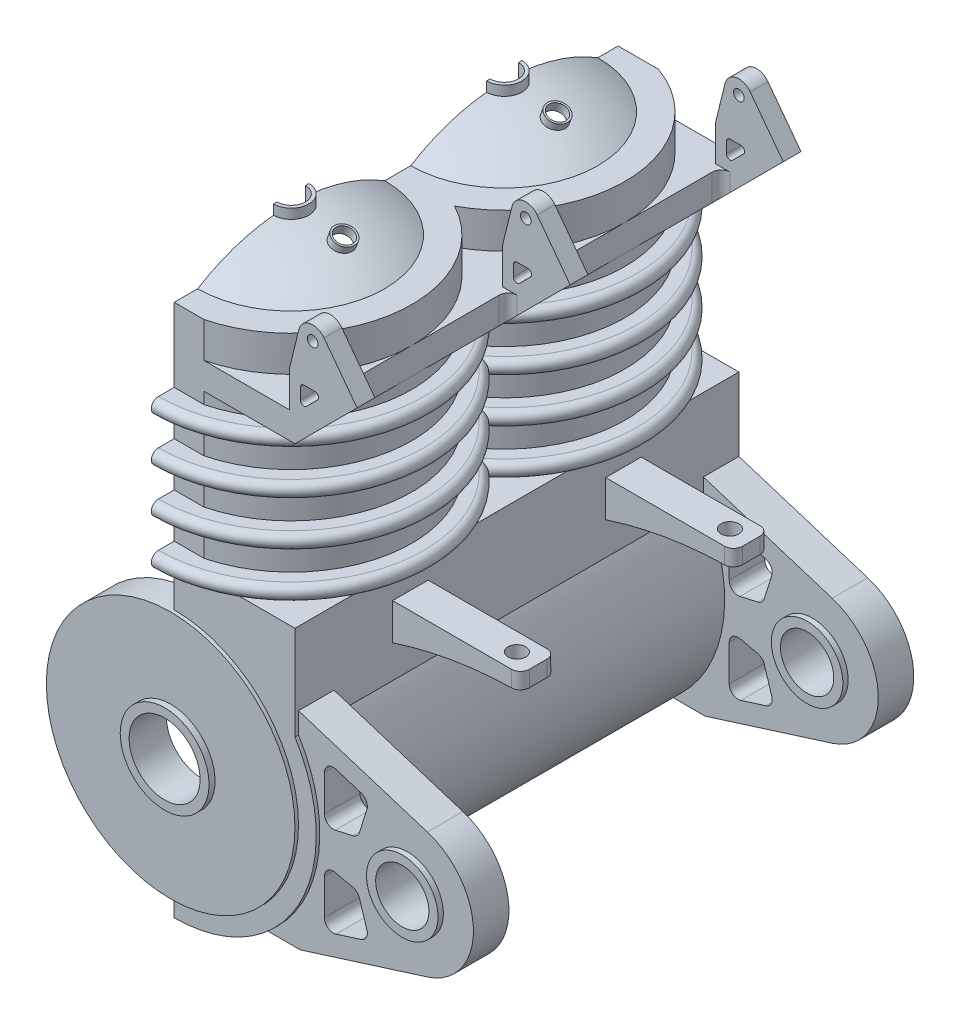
from build123d import *

# Parameters (mm, degrees)
EXTRUDE_1_DEPTH        = 25
SKETCH_2_R             = 5
CUT_EXTRUDE_1_DEPTH    = 20
SKETCH_3_R             = 7
CUT_EXTRUDE_2_DEPTH    = 39.394275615
CUT_EXTRUDE_3_DEPTH    = 9
SKETCH_5_W             = 0.175
SKETCH_5_H             = 0.8
SKETCH_5_W_2           = 0.505
SKETCH_5_H_2           = 10
REVOLVE_1_ANGLE        = 180
PATTERN_LINEAR_1_COUNT = 2
PATTERN_LINEAR_1_PITCH = 12
SKETCH_6_R             = 5
CUT_EXTRUDE_4_DEPTH    = 12
EXTRUDE_START          = -1
SKETCH_7_R             = 7
SKETCH_7_R_2           = 2.5
EXTRUDE_2_DEPTH        = 1.5
PATTERN_LINEAR_2_COUNT = 3
PATTERN_LINEAR_2_PITCH = 12
EXTRUDE_START_2        = 0.2
SKETCH_8_R             = 2.5
EXTRUDE_3_DEPTH        = 0.2
EXTRUDE_START_3        = -1.6
SKETCH_9_R             = 2.5
SKETCH_9_R_2           = 2
EXTRUDE_4_DEPTH        = 2.1
PATTERN_LINEAR_3_COUNT = 3
PATTERN_LINEAR_3_PITCH = 12.22
EXTRUDE_START_4        = 2
EXTRUDE_5_DEPTH        = 2
SKETCH_11_R            = 2.013
EXTRUDE_6_DEPTH        = 2
PATTERN_LINEAR_4_COUNT = 2
PATTERN_LINEAR_4_PITCH = 22.8
EXTRUDE_START_5        = 0.3
SKETCH_12_R            = 2.013
SKETCH_12_R_2          = 1.5
EXTRUDE_7_DEPTH        = 2.6
PATTERN_LINEAR_5_COUNT = 2
PATTERN_LINEAR_5_PITCH = 22.8
CUT_EXTRUDE_5_DEPTH    = 44.239106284
REVOLVE_2_ANGLE        = 180
PATTERN_LINEAR_6_COUNT = 2
PATTERN_LINEAR_6_PITCH = 12
SKETCH_15_R            = 0.995
CUT_EXTRUDE_6_DEPTH    = 44.239106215
EXTRUDE_START_6        = 1.2
EXTRUDE_8_DEPTH        = 0.8
SKETCH_17_R            = 0.6
CUT_EXTRUDE_7_DEPTH    = 41.878105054
SKETCH_18_R            = 0.3
EXTRUDE_9_DEPTH        = 1
PATTERN_LINEAR_7_COUNT = 3
PATTERN_LINEAR_7_PITCH = 12
FILLET_1_R             = 0.5
EXTRUDE_START_7        = -5.5
EXTRUDE_10_DEPTH       = 2
PATTERN_LINEAR_8_COUNT = 2
PATTERN_LINEAR_8_PITCH = 12
SKETCH_20_R            = 0.5
CUT_EXTRUDE_8_DEPTH    = 2
FILLET_2_R             = 0.5
SKETCH_21_W            = 6.181421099
SKETCH_21_H            = 2.439621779
CUT_EXTRUDE_9_DEPTH    = 45.650871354
SKETCH_22_R            = 0.3
EXTRUDE_11_DEPTH       = 1
PATTERN_LINEAR_9_COUNT = 3
PATTERN_LINEAR_9_PITCH = 12
EXTRUDE_START_8        = 1.9
SKETCH_17_2_R          = 0.6
SKETCH_17_2_R_2        = 0.5
EXTRUDE_1_2_DEPTH      = 0.5


with BuildPart() as part:
    # Sketch 1 → Extrude 1 (new body)
    with BuildSketch(Plane.XY):
        with BuildLine():
            Line((6.8, 28.02), (0, 28.02))
            Line((0, 28.02), (0, 0))
            ThreePointArc((0, 0), (6.989781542, 4.108605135), (6.8, 12.214261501))
            Line((6.8, 12.214261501), (6.8, 28.02))
        make_face()
    extrude(amount=EXTRUDE_1_DEPTH)

    # Sketch 2 → Cut-Extrude 1 (cut)
    with BuildSketch(Plane(origin=(0, 28.02, 0), x_dir=(1, 0, 0), z_dir=(0, 1, 0))):
        with Locations((0, -18.41)):
            Circle(SKETCH_2_R)
        with Locations((0, -6.41)):
            Circle(SKETCH_2_R)
    extrude(amount=-CUT_EXTRUDE_1_DEPTH, mode=Mode.SUBTRACT)

    # Sketch 3 → Cut-Extrude 2 (cut, through all)
    with BuildSketch(Plane.XY.offset(25)):
        with Locations((0, 8.02)):
            Circle(SKETCH_3_R)
    extrude(amount=-CUT_EXTRUDE_2_DEPTH, mode=Mode.SUBTRACT)

    # Sketch 4 → Cut-Extrude 3 (cut)
    with BuildSketch(Plane(origin=(0, 26.52, 0), x_dir=(1, 0, 0), z_dir=(0, 1, 0))):
        with BuildLine():
            Line((0, -25.21), (13.372737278, -25.21))
            Line((13.372737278, -25.21), (13.372737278, 0.39))
            Line((13.372737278, 0.39), (0, 0.39))
            ThreePointArc((0, 0.39), (6.596969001, -4.76075775), (3.2, -12.41))
            ThreePointArc((3.2, -12.41), (6.596969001, -20.05924225), (0, -25.21))
        make_face()
    extrude(amount=-CUT_EXTRUDE_3_DEPTH, mode=Mode.SUBTRACT)

    # Sketch 5 → Revolve 1 (revolve)
    with BuildSketch(Plane.ZY):
        with BuildLine():
            Line((0, 25.07), (0, 25.87))
            Line((0, 25.87), (-1.07, 25.87))
            ThreePointArc((-1.07, 25.87), (-1.47, 25.47), (-1.07, 25.07))
            Line((-1.07, 25.07), (0, 25.07))
        make_face()
        with Locations((0.0875, 25.47)):
            Rectangle(SKETCH_5_W, SKETCH_5_H)
        with Locations((0.4275, 22.17)):
            Rectangle(SKETCH_5_W_2, SKETCH_5_H_2)
        with BuildLine():
            Line((0, 22.57), (0, 23.37))
            Line((0, 23.37), (-1.07, 23.37))
            ThreePointArc((-1.07, 23.37), (-1.47, 22.97), (-1.07, 22.57))
            Line((-1.07, 22.57), (0, 22.57))
        make_face()
        with Locations((0.0875, 22.97)):
            Rectangle(SKETCH_5_W, SKETCH_5_H)
        with Locations((0.0875, 20.47)):
            Rectangle(SKETCH_5_W, SKETCH_5_H)
        with BuildLine():
            Line((-1.07, 20.07), (0, 20.07))
            Line((0, 20.07), (0, 20.87))
            Line((0, 20.87), (-1.07, 20.87))
            ThreePointArc((-1.07, 20.87), (-1.47, 20.47), (-1.07, 20.07))
        make_face()
        with Locations((0.0875, 17.97)):
            Rectangle(SKETCH_5_W, SKETCH_5_H)
        with BuildLine():
            Line((-1.07, 17.57), (0, 17.57))
            Line((0, 17.57), (0, 18.37))
            Line((0, 18.37), (-1.07, 18.37))
            ThreePointArc((-1.07, 18.37), (-1.47, 17.97), (-1.07, 17.57))
        make_face()
    revolve_1 = revolve(axis=Axis((0, 28.02, 6.41), (0, -1, 0)), revolution_arc=REVOLVE_1_ANGLE)

    # Pattern Linear 1: Revolve 1 ×2
    with Locations(*[(0, 0, i * PATTERN_LINEAR_1_PITCH) for i in range(1, PATTERN_LINEAR_1_COUNT)]):
        add(revolve_1)

    # Sketch 6 → Cut-Extrude 4 (cut)
    with BuildSketch(Plane(origin=(0, 28.02, 0), x_dir=(1, 0, 0), z_dir=(0, 1, 0))):
        with Locations((0, -6.41)):
            Circle(SKETCH_6_R)
        with Locations((0, -18.41)):
            Circle(SKETCH_6_R)
    extrude(amount=-CUT_EXTRUDE_4_DEPTH, mode=Mode.SUBTRACT)

    # Sketch 7 → Extrude 2 (add)
    with BuildSketch(Plane(origin=(0, 0, 0), x_dir=(-1, 0, 0), z_dir=(0, 0, -1)).offset(EXTRUDE_START)):
        with Locations((0, 8.02)):
            Circle(SKETCH_7_R)
        with Locations((0, 8.02)):
            Circle(SKETCH_7_R_2, mode=Mode.SUBTRACT)
    extrude_2 = extrude(amount=EXTRUDE_2_DEPTH)

    # Pattern Linear 2: Extrude 2 ×3
    with Locations(*[(0, 0, i * PATTERN_LINEAR_2_PITCH) for i in range(1, PATTERN_LINEAR_2_COUNT)]):
        add(extrude_2)

    # Sketch 8 → Extrude 3 (add)
    with BuildSketch(Plane.XY.offset(25).offset(EXTRUDE_START_2)):
        with BuildLine():
            ThreePointArc((0, 1.02), (7, 8.02), (0, 15.02))
            ThreePointArc((0, 15.02), (-7, 8.02), (0, 1.02))
        make_face()
        with Locations(Location((0, 8.02, 0), (0, 0, 180))):
            Circle(SKETCH_8_R, mode=Mode.SUBTRACT)
    extrude(amount=-EXTRUDE_3_DEPTH)

    # Sketch 9 → Extrude 4 (add)
    with BuildSketch(Plane(origin=(0, 0, -0.5), x_dir=(-1, 0, 0), z_dir=(0, 0, -1)).offset(EXTRUDE_START_3)):
        with Locations((0, 8.02)):
            Circle(SKETCH_9_R)
        with Locations((0, 8.02)):
            Circle(SKETCH_9_R_2, mode=Mode.SUBTRACT)
    extrude_4 = extrude(amount=EXTRUDE_4_DEPTH)

    # Pattern Linear 3: Extrude 4 ×3
    with Locations(*[(0, 0, i * PATTERN_LINEAR_3_PITCH) for i in range(1, PATTERN_LINEAR_3_COUNT)]):
        add(extrude_4)

    # Sketch 10 → Extrude 5 (add)
    with BuildSketch(Plane(origin=(0, 28.02, 0), x_dir=(1, 0, 0), z_dir=(0, 1, 0)).offset(EXTRUDE_START_4)):
        with BuildLine():
            Line((0, -13.41), (0, -11.41))
            ThreePointArc((0, -11.41), (5, -6.41), (0, -1.41))
            Line((0, -1.41), (0, 0))
            Line((0, 0), (2.269779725, 0))
            ThreePointArc((2.269779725, 0), (5.553129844, -2.485366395), (6.8, -6.41))
            ThreePointArc((6.8, -6.41), (5.830951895, -9.908571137), (3.2, -12.41))
            ThreePointArc((3.2, -12.41), (5.830951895, -14.911428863), (6.8, -18.41))
            ThreePointArc((6.8, -18.41), (5.368553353, -22.583563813), (1.676872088, -25))
            Line((1.676872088, -25), (0, -25))
            Line((0, -25), (0, -23.41))
            ThreePointArc((0, -23.41), (5, -18.41), (0, -13.41))
        make_face()
    extrude(amount=-EXTRUDE_5_DEPTH)

    # Sketch 11 → Extrude 6 (add)
    with BuildSketch(Plane(origin=(0, 0, 0), x_dir=(-1, 0, 0), z_dir=(0, 0, -1))):
        with BuildLine():
            Line((-6.8, 13.401593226), (-14.058716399, 11.112928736))
            ThreePointArc((-14.058716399, 11.112928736), (-16.651, 7.5775), (-14.058716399, 4.042071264))
            Line((-14.058716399, 4.042071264), (-6.901603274, 1.785442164))
            Line((-6.901603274, 1.785442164), (-5.037784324, 1.785442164))
            ThreePointArc((-5.037784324, 1.785442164), (-7.888178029, 6.667090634), (-6.8, 12.214261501))
            Line((-6.8, 12.214261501), (-6.8, 13.401593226))
        make_face()
        with Locations((-12.944, 7.5775)):
            Circle(SKETCH_11_R, mode=Mode.SUBTRACT)
    extrude_6 = extrude(amount=-EXTRUDE_6_DEPTH)

    # Pattern Linear 4: Extrude 6 ×2
    with Locations(*[(0, 0, i * PATTERN_LINEAR_4_PITCH) for i in range(1, PATTERN_LINEAR_4_COUNT)]):
        add(extrude_6)

    # Sketch 12 → Extrude 7 (add)
    with BuildSketch(Plane(origin=(0, 0, 0), x_dir=(-1, 0, 0), z_dir=(0, 0, -1)).offset(EXTRUDE_START_5)):
        with Locations((-12.944, 7.5775)):
            Circle(SKETCH_12_R)
        with Locations((-12.944, 7.5775)):
            Circle(SKETCH_12_R_2, mode=Mode.SUBTRACT)
    extrude_7 = extrude(amount=-EXTRUDE_7_DEPTH)

    # Pattern Linear 5: Extrude 7 ×2
    with Locations(*[(0, 0, i * PATTERN_LINEAR_5_PITCH) for i in range(1, PATTERN_LINEAR_5_COUNT)]):
        add(extrude_7)

    # Sketch 13 → Cut-Extrude 5 (cut, through all)
    with BuildSketch(Plane(origin=(0, 0, 0), x_dir=(-1, 0, 0), z_dir=(0, 0, -1))):
        with BuildLine():
            Line((-8.908802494, 11.596143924), (-10.329244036, 11.148280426))
            ThreePointArc((-10.329244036, 11.148280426), (-10.622396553, 10.902296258), (-10.655749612, 10.521069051))
            Line((-10.655749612, 10.521069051), (-10.230013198, 9.170805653))
            ThreePointArc((-10.230013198, 9.170805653), (-10.091473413, 8.953000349), (-9.862761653, 8.833320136))
            Line((-9.862761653, 8.833320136), (-8.868056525, 8.609831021))
            ThreePointArc((-8.868056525, 8.609831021), (-8.44604238, 8.707282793), (-8.258449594, 9.097669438))
            Line((-8.258449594, 9.097669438), (-8.258449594, 11.119285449))
            ThreePointArc((-8.258449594, 11.119285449), (-8.46279477, 11.522507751), (-8.908802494, 11.596143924))
        make_face()
        with BuildLine():
            Line((-8.258449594, 6.057330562), (-8.258449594, 4.035714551))
            ThreePointArc((-8.258449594, 4.035714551), (-8.46279477, 3.632492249), (-8.908802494, 3.558856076))
            Line((-8.908802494, 3.558856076), (-10.329244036, 4.006719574))
            ThreePointArc((-10.329244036, 4.006719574), (-10.622396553, 4.252703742), (-10.655749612, 4.633930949))
            Line((-10.655749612, 4.633930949), (-10.230013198, 5.984194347))
            ThreePointArc((-10.230013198, 5.984194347), (-10.091473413, 6.201999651), (-9.862761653, 6.321679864))
            Line((-9.862761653, 6.321679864), (-8.868056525, 6.545168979))
            ThreePointArc((-8.868056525, 6.545168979), (-8.44604238, 6.447717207), (-8.258449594, 6.057330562))
        make_face()
    extrude(amount=-CUT_EXTRUDE_5_DEPTH, mode=Mode.SUBTRACT)

    # Sketch 14 → Revolve 2 (revolve)
    with BuildSketch(Plane.ZY):
        with BuildLine():
            Line((18.41, 31.4), (18.41, 31.52))
            ThreePointArc((18.41, 31.52), (15.671387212, 31.137692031), (13.142173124, 30.02))
            Line((13.142173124, 30.02), (13.373691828, 30.02))
            ThreePointArc((13.373691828, 30.02), (15.799023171, 31.048756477), (18.41, 31.4))
        make_face()
    revolve_2 = revolve(axis=Axis((0, 30.02, 18.41), (0, -1, 0)), revolution_arc=REVOLVE_2_ANGLE)

    # Pattern Linear 6: Revolve 2 ×2
    with Locations(*[(0, 0, -i * PATTERN_LINEAR_6_PITCH) for i in range(1, PATTERN_LINEAR_6_COUNT)]):
        add(revolve_2)

    # Sketch 15 → Cut-Extrude 6 (cut, through all)
    with BuildSketch(Plane(origin=(0, 30.02, 0), x_dir=(1, 0, 0), z_dir=(0, 1, 0))):
        with Locations((0, -6.41)):
            Circle(SKETCH_15_R)
        with Locations((0, -18.41)):
            Circle(SKETCH_15_R)
    extrude(amount=CUT_EXTRUDE_6_DEPTH, mode=Mode.SUBTRACT)

    # Sketch 16 → Extrude 8 (add)
    with BuildSketch(Plane(origin=(0, 30.02, 0), x_dir=(1, 0, 0), z_dir=(0, 1, 0)).offset(EXTRUDE_START_6)):
        with BuildLine():
            Line((0, -17.415), (0, -17.61))
            ThreePointArc((0, -17.61), (0.8, -18.41), (0, -19.21))
            Line((0, -19.21), (0, -19.405))
            ThreePointArc((0, -19.405), (0.995, -18.41), (0, -17.415))
        make_face()
        with BuildLine():
            Line((0, -5.415), (0, -5.61))
            ThreePointArc((0, -5.61), (0.8, -6.41), (0, -7.21))
            Line((0, -7.21), (0, -7.405))
            ThreePointArc((0, -7.405), (0.995, -6.41), (0, -5.415))
        make_face()
    extrude(amount=EXTRUDE_8_DEPTH)

    # Sketch 17 → Cut-Extrude 7 (cut, through all)
    with BuildSketch(Plane(origin=(9.648242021, 26.508327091, 0), x_dir=(0, 0, 1), z_dir=(0.34202014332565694, 0.9396926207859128, 0))):
        with Locations(Location((6.41, -7.951484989, 0), (0, 0, 242.991984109))):
            Circle(SKETCH_17_R)
        with Locations(Location((18.41, -7.951484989, 0), (0, 0, 242.991984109))):
            Circle(SKETCH_17_R)
    extrude(amount=CUT_EXTRUDE_7_DEPTH, mode=Mode.SUBTRACT)

    # Sketch 18 → Extrude 9 (add)
    with BuildSketch(Plane(origin=(0, 0, 0), x_dir=(-1, 0, 0), z_dir=(0, 0, -1))):
        with BuildLine():
            Line((-6.8, 26.52), (-6.485, 26.52))
            Line((-6.485, 26.52), (-6.485, 30.02))
            Line((-6.485, 30.02), (-8.8, 30.02))
            Line((-8.8, 30.02), (-9.924299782, 31.144299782))
            ThreePointArc((-9.924299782, 31.144299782), (-10.674299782, 31.144299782), (-10.674299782, 30.394299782))
            Line((-10.674299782, 30.394299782), (-6.8, 26.52))
        make_face()
        with Locations((-10.299299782, 30.769299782)):
            Circle(SKETCH_18_R, mode=Mode.SUBTRACT)
        with BuildLine():
            Line((-8.07200819, 29.29200819), (-7.44866813, 28.66866813))
            ThreePointArc((-7.44866813, 28.66866813), (-7.230710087, 28.625313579), (-7.107246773, 28.810089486))
            Line((-7.107246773, 28.810089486), (-7.107246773, 29.433429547))
            ThreePointArc((-7.107246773, 29.433429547), (-7.165825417, 29.574850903), (-7.307246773, 29.633429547))
            Line((-7.307246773, 29.633429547), (-7.930586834, 29.633429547))
            ThreePointArc((-7.930586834, 29.633429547), (-8.115362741, 29.509966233), (-8.07200819, 29.29200819))
        make_face(mode=Mode.SUBTRACT)
    extrude_9 = extrude(amount=-EXTRUDE_9_DEPTH)

    # Pattern Linear 7: Extrude 9 ×3
    with Locations(*[(0, 0, i * PATTERN_LINEAR_7_PITCH) for i in range(1, PATTERN_LINEAR_7_COUNT)]):
        add(extrude_9)

    # Fillet 1
    fillet_1_edges = [part.edges().sort_by_distance(p)[0] for p in [
        (6.8, 27.27, 1),
        (6.8, 27.27, 13),
        (6.8, 27.27, 12),
        (6.8, 27.27, 24),
    ]]
    fillet(fillet_1_edges, radius=FILLET_1_R)

    # Sketch 19 → Extrude 10 (add)
    with BuildSketch(Plane(origin=(0, 0, 0), x_dir=(-1, 0, 0), z_dir=(0, 0, -1)).offset(EXTRUDE_START_7)):
        with BuildLine():
            Line((-6.8, 16.12), (-14, 16.12))
            Line((-14, 16.12), (-14, 15.22))
            ThreePointArc((-14, 15.22), (-10.353894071, 14.9291592), (-6.8, 14.063992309))
            Line((-6.8, 14.063992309), (-6.8, 16.12))
        make_face()
    extrude_10 = extrude(amount=-EXTRUDE_10_DEPTH)

    # Pattern Linear 8: Extrude 10 ×2
    with Locations(*[(0, 0, i * PATTERN_LINEAR_8_PITCH) for i in range(1, PATTERN_LINEAR_8_COUNT)]):
        add(extrude_10)

    # Sketch 20 → Cut-Extrude 8 (cut)
    with BuildSketch(Plane(origin=(0, 16.12, 0), x_dir=(1, 0, 0), z_dir=(0, 1, 0))):
        with Locations(Location((12.8, -6.5, 0), (0, 0, 270))):
            Circle(SKETCH_20_R)
        with Locations(Location((12.8, -18.5, 0), (0, 0, 270))):
            Circle(SKETCH_20_R)
    extrude(amount=-CUT_EXTRUDE_8_DEPTH, mode=Mode.SUBTRACT)

    # Fillet 2
    fillet_2_edges = [part.edges().sort_by_distance(p)[0] for p in [
        (14, 15.67, 7.5),
        (14, 15.67, 5.5),
        (14, 15.67, 19.5),
        (14, 15.67, 17.5),
    ]]
    fillet(fillet_2_edges, radius=FILLET_2_R)

    # Sketch 21 → Cut-Extrude 9 (cut, through all)
    with BuildSketch(Plane(origin=(0, 0, 0), x_dir=(-1, 0, 0), z_dir=(0, 0, -1))):
        with Locations((-10.412614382, 31.23981089)):
            Rectangle(SKETCH_21_W, SKETCH_21_H)
    extrude(amount=-CUT_EXTRUDE_9_DEPTH, mode=Mode.SUBTRACT)

    # Sketch 22 → Extrude 11 (add)
    with BuildSketch(Plane(origin=(0, 0, 0), x_dir=(-1, 0, 0), z_dir=(0, 0, -1))):
        with BuildLine():
            Line((-10.3, 30.02), (-6.485, 30.02))
            Line((-6.485, 30.02), (-7.023090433, 32.21081804))
            ThreePointArc((-7.023090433, 32.21081804), (-7.640023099, 32.803841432), (-8.44, 32.5))
            Line((-8.44, 32.5), (-10.3, 30.02))
        make_face()
        with Locations((-7.8, 32.02)):
            Circle(SKETCH_22_R, mode=Mode.SUBTRACT)
    extrude_11 = extrude(amount=-EXTRUDE_11_DEPTH)

    # Pattern Linear 9: Extrude 11 ×3
    with Locations(*[(0, 0, i * PATTERN_LINEAR_9_PITCH) for i in range(1, PATTERN_LINEAR_9_COUNT)]):
        add(extrude_11)

    # Sketch 17_2 → Extrude 1 2 (add)
    # profile 1 of 2: a face of its own
    with BuildSketch(Plane(origin=(9.648242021, 26.508327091, 0), x_dir=(0, 0, 1), z_dir=(0.34202014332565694, 0.9396926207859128, 0)).offset(EXTRUDE_START_8)):
        with Locations((6.41, -7.951484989)):
            Circle(SKETCH_17_2_R)
        with Locations((6.41, -7.951484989)):
            Circle(SKETCH_17_2_R_2, mode=Mode.SUBTRACT)
    # profile 2 of 2: a face of its own
    with BuildSketch(Plane(origin=(9.648242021, 26.508327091, 0), x_dir=(0, 0, 1), z_dir=(0.34202014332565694, 0.9396926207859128, 0)).offset(EXTRUDE_START_8)):
        with Locations((18.41, -7.951484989)):
            Circle(SKETCH_17_2_R)
        with Locations((18.41, -7.951484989)):
            Circle(SKETCH_17_2_R_2, mode=Mode.SUBTRACT)
    extrude(amount=EXTRUDE_1_2_DEPTH)


solid = part.part
